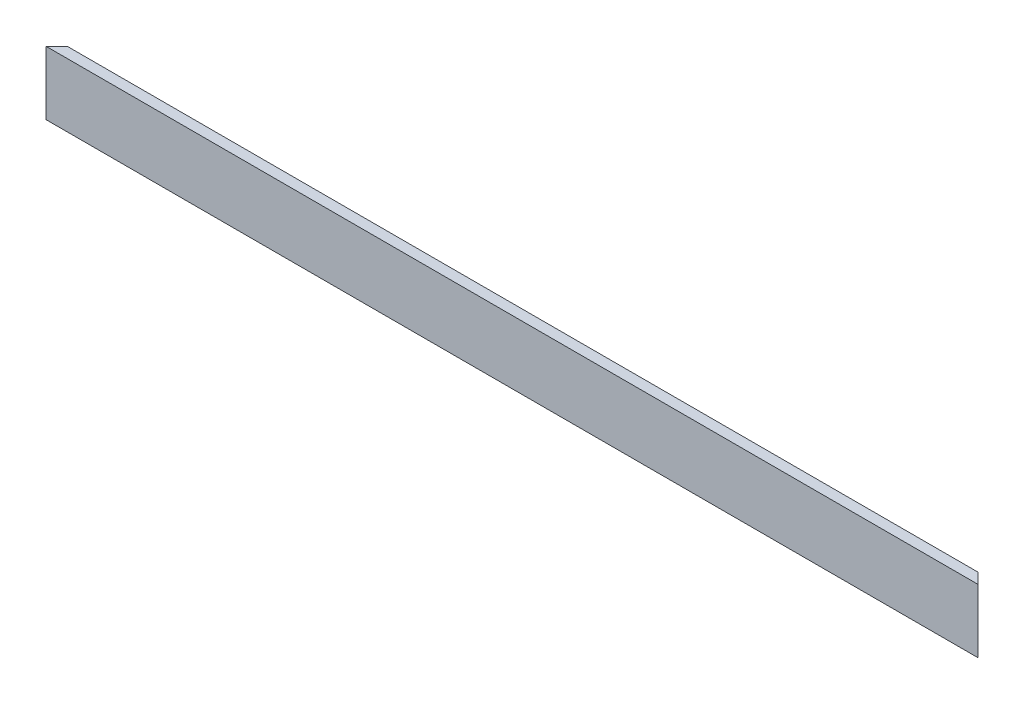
ISO-10303-21;
HEADER;
FILE_DESCRIPTION(('STEP AP214'),'2;1');
FILE_NAME('part.step','',(''),(''),'','','');
FILE_SCHEMA(('AUTOMOTIVE_DESIGN { 1 0 10303 214 1 1 1 1 }'));
ENDSEC;
DATA;
#1=APPLICATION_CONTEXT('core data for automotive mechanical design processes');
#2=APPLICATION_PROTOCOL_DEFINITION('international standard','automotive_design',2000,#1);
#3=PRODUCT_CONTEXT('',#1,'mechanical');
#4=PRODUCT('Part','Part','',(#3));
#5=PRODUCT_RELATED_PRODUCT_CATEGORY('part','',(#4));
#6=PRODUCT_DEFINITION_FORMATION('','',#4);
#7=PRODUCT_DEFINITION_CONTEXT('part definition',#1,'design');
#8=PRODUCT_DEFINITION('design','',#6,#7);
#9=PRODUCT_DEFINITION_SHAPE('','',#8);
#10=(LENGTH_UNIT() NAMED_UNIT(*) SI_UNIT(.MILLI.,.METRE.));
#11=(NAMED_UNIT(*) PLANE_ANGLE_UNIT() SI_UNIT($,.RADIAN.));
#12=(NAMED_UNIT(*) SI_UNIT($,.STERADIAN.) SOLID_ANGLE_UNIT());
#13=UNCERTAINTY_MEASURE_WITH_UNIT(LENGTH_MEASURE(1.E-05),#10,'distance_accuracy_value','');
#14=(GEOMETRIC_REPRESENTATION_CONTEXT(3) GLOBAL_UNCERTAINTY_ASSIGNED_CONTEXT((#13)) GLOBAL_UNIT_ASSIGNED_CONTEXT((#10,
#11,#12)) REPRESENTATION_CONTEXT('',''));
#15=CARTESIAN_POINT('',(0.,0.,0.));
#16=DIRECTION('',(0.,0.,1.));
#17=DIRECTION('',(1.,0.,0.));
#18=AXIS2_PLACEMENT_3D('',#15,#16,#17);
#19=CARTESIAN_POINT('',(558.8,0.,0.));
#20=DIRECTION('',(0.,1.,0.));
#21=DIRECTION('',(0.,0.,1.));
#22=AXIS2_PLACEMENT_3D('',#19,#20,#21);
#23=PLANE('',#22);
#24=DIRECTION('',(0.707106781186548,0.,0.707106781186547));
#25=VECTOR('',#24,1.);
#26=CARTESIAN_POINT('',(558.8,0.,0.));
#27=LINE('',#26,#25);
#28=CARTESIAN_POINT('',(520.7,0.,-38.1));
#29=VERTEX_POINT('',#28);
#30=CARTESIAN_POINT('',(558.8,0.,0.));
#31=VERTEX_POINT('',#30);
#32=EDGE_CURVE('E78',#29,#31,#27,.T.);
#33=ORIENTED_EDGE('',*,*,#32,.T.);
#34=DIRECTION('',(-1.,0.,0.));
#35=VECTOR('',#34,1.);
#36=CARTESIAN_POINT('',(558.8,0.,0.));
#37=LINE('',#36,#35);
#38=CARTESIAN_POINT('',(0.,0.,0.));
#39=VERTEX_POINT('',#38);
#40=EDGE_CURVE('E99',#31,#39,#37,.T.);
#41=ORIENTED_EDGE('',*,*,#40,.T.);
#42=DIRECTION('',(0.707106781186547,0.,-0.707106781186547));
#43=VECTOR('',#42,1.);
#44=CARTESIAN_POINT('',(0.,0.,0.));
#45=LINE('',#44,#43);
#46=CARTESIAN_POINT('',(38.1,0.,-38.1));
#47=VERTEX_POINT('',#46);
#48=EDGE_CURVE('E98',#39,#47,#45,.T.);
#49=ORIENTED_EDGE('',*,*,#48,.T.);
#50=DIRECTION('',(-1.,0.,0.));
#51=VECTOR('',#50,1.);
#52=CARTESIAN_POINT('',(558.8,0.,-38.1));
#53=LINE('',#52,#51);
#54=EDGE_CURVE('E11',#29,#47,#53,.T.);
#55=ORIENTED_EDGE('',*,*,#54,.F.);
#56=EDGE_LOOP('',(#33,#41,#49,#55));
#57=FACE_BOUND('',#56,.T.);
#58=ADVANCED_FACE('F33',(#57),#23,.F.);
#59=CARTESIAN_POINT('',(558.8,0.,-38.1));
#60=DIRECTION('',(0.,0.,1.));
#61=DIRECTION('',(1.,0.,0.));
#62=AXIS2_PLACEMENT_3D('',#59,#60,#61);
#63=PLANE('',#62);
#64=DIRECTION('',(0.,-1.,0.));
#65=VECTOR('',#64,1.);
#66=CARTESIAN_POINT('',(520.7,38.1,-38.1));
#67=LINE('',#66,#65);
#68=CARTESIAN_POINT('',(520.7,6.35000000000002,-38.1));
#69=VERTEX_POINT('',#68);
#70=EDGE_CURVE('E81',#69,#29,#67,.T.);
#71=ORIENTED_EDGE('',*,*,#70,.T.);
#72=ORIENTED_EDGE('',*,*,#54,.T.);
#73=DIRECTION('',(0.,-1.,0.));
#74=VECTOR('',#73,1.);
#75=CARTESIAN_POINT('',(38.1,38.1,-38.1));
#76=LINE('',#75,#74);
#77=CARTESIAN_POINT('',(38.1,6.35000000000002,-38.1));
#78=VERTEX_POINT('',#77);
#79=EDGE_CURVE('E106',#78,#47,#76,.T.);
#80=ORIENTED_EDGE('',*,*,#79,.F.);
#81=DIRECTION('',(-1.,0.,0.));
#82=VECTOR('',#81,1.);
#83=CARTESIAN_POINT('',(558.8,6.35,-38.1));
#84=LINE('',#83,#82);
#85=EDGE_CURVE('E41',#69,#78,#84,.T.);
#86=ORIENTED_EDGE('',*,*,#85,.F.);
#87=EDGE_LOOP('',(#71,#72,#80,#86));
#88=FACE_BOUND('',#87,.T.);
#89=ADVANCED_FACE('F92',(#88),#63,.F.);
#90=CARTESIAN_POINT('',(558.8,6.35,-38.1));
#91=DIRECTION('',(0.,-1.,0.));
#92=DIRECTION('',(0.,0.,-1.));
#93=AXIS2_PLACEMENT_3D('',#90,#91,#92);
#94=PLANE('',#93);
#95=DIRECTION('',(0.707106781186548,0.,0.707106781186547));
#96=VECTOR('',#95,1.);
#97=CARTESIAN_POINT('',(539.75,6.35,-19.05));
#98=LINE('',#97,#96);
#99=CARTESIAN_POINT('',(552.45,6.35,-6.35000000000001));
#100=VERTEX_POINT('',#99);
#101=EDGE_CURVE('E103',#69,#100,#98,.T.);
#102=ORIENTED_EDGE('',*,*,#101,.F.);
#103=ORIENTED_EDGE('',*,*,#85,.T.);
#104=DIRECTION('',(0.707106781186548,0.,-0.707106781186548));
#105=VECTOR('',#104,1.);
#106=CARTESIAN_POINT('',(298.45,6.35000000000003,-298.45));
#107=LINE('',#106,#105);
#108=CARTESIAN_POINT('',(6.34999999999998,6.35,-6.35000000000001));
#109=VERTEX_POINT('',#108);
#110=EDGE_CURVE('E114',#109,#78,#107,.T.);
#111=ORIENTED_EDGE('',*,*,#110,.F.);
#112=DIRECTION('',(-1.,0.,0.));
#113=VECTOR('',#112,1.);
#114=CARTESIAN_POINT('',(558.8,6.35,-6.35000000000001));
#115=LINE('',#114,#113);
#116=EDGE_CURVE('E126',#100,#109,#115,.T.);
#117=ORIENTED_EDGE('',*,*,#116,.F.);
#118=EDGE_LOOP('',(#102,#103,#111,#117));
#119=FACE_BOUND('',#118,.T.);
#120=ADVANCED_FACE('F129',(#119),#94,.F.);
#121=CARTESIAN_POINT('',(558.8,38.1,-6.35));
#122=DIRECTION('',(0.,0.,1.));
#123=DIRECTION('',(0.,-1.,0.));
#124=AXIS2_PLACEMENT_3D('',#121,#122,#123);
#125=PLANE('',#124);
#126=DIRECTION('',(0.,1.,0.));
#127=VECTOR('',#126,1.);
#128=CARTESIAN_POINT('',(552.45,38.1,-6.35));
#129=LINE('',#128,#127);
#130=CARTESIAN_POINT('',(552.45,38.1,-6.34999999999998));
#131=VERTEX_POINT('',#130);
#132=EDGE_CURVE('E95',#100,#131,#129,.T.);
#133=ORIENTED_EDGE('',*,*,#132,.F.);
#134=ORIENTED_EDGE('',*,*,#116,.T.);
#135=DIRECTION('',(0.,-1.,0.));
#136=VECTOR('',#135,1.);
#137=CARTESIAN_POINT('',(6.34999999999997,38.0999999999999,-6.35));
#138=LINE('',#137,#136);
#139=CARTESIAN_POINT('',(6.34999999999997,38.1,-6.34999999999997));
#140=VERTEX_POINT('',#139);
#141=EDGE_CURVE('E111',#140,#109,#138,.T.);
#142=ORIENTED_EDGE('',*,*,#141,.F.);
#143=DIRECTION('',(-1.,0.,0.));
#144=VECTOR('',#143,1.);
#145=CARTESIAN_POINT('',(558.8,38.1,-6.35));
#146=LINE('',#145,#144);
#147=EDGE_CURVE('E124',#131,#140,#146,.T.);
#148=ORIENTED_EDGE('',*,*,#147,.F.);
#149=EDGE_LOOP('',(#133,#134,#142,#148));
#150=FACE_BOUND('',#149,.T.);
#151=ADVANCED_FACE('F137',(#150),#125,.F.);
#152=CARTESIAN_POINT('',(558.8,38.1,0.));
#153=DIRECTION('',(0.,-1.,0.));
#154=DIRECTION('',(0.,0.,-1.));
#155=AXIS2_PLACEMENT_3D('',#152,#153,#154);
#156=PLANE('',#155);
#157=DIRECTION('',(0.707106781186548,0.,0.707106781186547));
#158=VECTOR('',#157,1.);
#159=CARTESIAN_POINT('',(558.8,38.1,0.));
#160=LINE('',#159,#158);
#161=CARTESIAN_POINT('',(558.8,38.1,0.));
#162=VERTEX_POINT('',#161);
#163=EDGE_CURVE('E47',#131,#162,#160,.T.);
#164=ORIENTED_EDGE('',*,*,#163,.F.);
#165=ORIENTED_EDGE('',*,*,#147,.T.);
#166=DIRECTION('',(0.707106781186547,0.,-0.707106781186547));
#167=VECTOR('',#166,1.);
#168=CARTESIAN_POINT('',(0.,38.1,0.));
#169=LINE('',#168,#167);
#170=CARTESIAN_POINT('',(0.,38.1,0.));
#171=VERTEX_POINT('',#170);
#172=EDGE_CURVE('E102',#171,#140,#169,.T.);
#173=ORIENTED_EDGE('',*,*,#172,.F.);
#174=DIRECTION('',(-1.,0.,0.));
#175=VECTOR('',#174,1.);
#176=CARTESIAN_POINT('',(558.8,38.1,0.));
#177=LINE('',#176,#175);
#178=EDGE_CURVE('E121',#162,#171,#177,.T.);
#179=ORIENTED_EDGE('',*,*,#178,.F.);
#180=EDGE_LOOP('',(#164,#165,#173,#179));
#181=FACE_BOUND('',#180,.T.);
#182=ADVANCED_FACE('F141',(#181),#156,.F.);
#183=CARTESIAN_POINT('',(558.8,0.,0.));
#184=DIRECTION('',(0.,0.,-1.));
#185=DIRECTION('',(-1.,0.,0.));
#186=AXIS2_PLACEMENT_3D('',#183,#184,#185);
#187=PLANE('',#186);
#188=DIRECTION('',(0.,-1.,0.));
#189=VECTOR('',#188,1.);
#190=CARTESIAN_POINT('',(0.,0.,0.));
#191=LINE('',#190,#189);
#192=EDGE_CURVE('E117',#171,#39,#191,.T.);
#193=ORIENTED_EDGE('',*,*,#192,.T.);
#194=ORIENTED_EDGE('',*,*,#40,.F.);
#195=DIRECTION('',(0.,-1.,0.));
#196=VECTOR('',#195,1.);
#197=CARTESIAN_POINT('',(558.8,0.,0.));
#198=LINE('',#197,#196);
#199=EDGE_CURVE('E84',#162,#31,#198,.T.);
#200=ORIENTED_EDGE('',*,*,#199,.F.);
#201=ORIENTED_EDGE('',*,*,#178,.T.);
#202=EDGE_LOOP('',(#193,#194,#200,#201));
#203=FACE_BOUND('',#202,.T.);
#204=ADVANCED_FACE('F143',(#203),#187,.F.);
#205=CARTESIAN_POINT('',(0.,38.1,0.));
#206=DIRECTION('',(-0.707106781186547,0.,-0.707106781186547));
#207=DIRECTION('',(-0.707106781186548,0.,0.707106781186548));
#208=AXIS2_PLACEMENT_3D('',#205,#206,#207);
#209=PLANE('',#208);
#210=ORIENTED_EDGE('',*,*,#110,.T.);
#211=ORIENTED_EDGE('',*,*,#79,.T.);
#212=ORIENTED_EDGE('',*,*,#48,.F.);
#213=ORIENTED_EDGE('',*,*,#192,.F.);
#214=ORIENTED_EDGE('',*,*,#172,.T.);
#215=ORIENTED_EDGE('',*,*,#141,.T.);
#216=EDGE_LOOP('',(#210,#211,#212,#213,#214,#215));
#217=FACE_BOUND('',#216,.T.);
#218=ADVANCED_FACE('F131',(#217),#209,.T.);
#219=CARTESIAN_POINT('',(558.8,38.1,0.));
#220=DIRECTION('',(0.707106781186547,0.,-0.707106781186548));
#221=DIRECTION('',(-0.707106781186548,0.,-0.707106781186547));
#222=AXIS2_PLACEMENT_3D('',#219,#220,#221);
#223=PLANE('',#222);
#224=ORIENTED_EDGE('',*,*,#101,.T.);
#225=ORIENTED_EDGE('',*,*,#132,.T.);
#226=ORIENTED_EDGE('',*,*,#163,.T.);
#227=ORIENTED_EDGE('',*,*,#199,.T.);
#228=ORIENTED_EDGE('',*,*,#32,.F.);
#229=ORIENTED_EDGE('',*,*,#70,.F.);
#230=EDGE_LOOP('',(#224,#225,#226,#227,#228,#229));
#231=FACE_BOUND('',#230,.T.);
#232=ADVANCED_FACE('F80',(#231),#223,.T.);
#233=CLOSED_SHELL('',(#58,#89,#120,#151,#182,#204,#218,#232));
#234=MANIFOLD_SOLID_BREP('B2',#233);
#235=ADVANCED_BREP_SHAPE_REPRESENTATION('',(#18,#234),#14);
#236=SHAPE_DEFINITION_REPRESENTATION(#9,#235);
ENDSEC;
END-ISO-10303-21;
